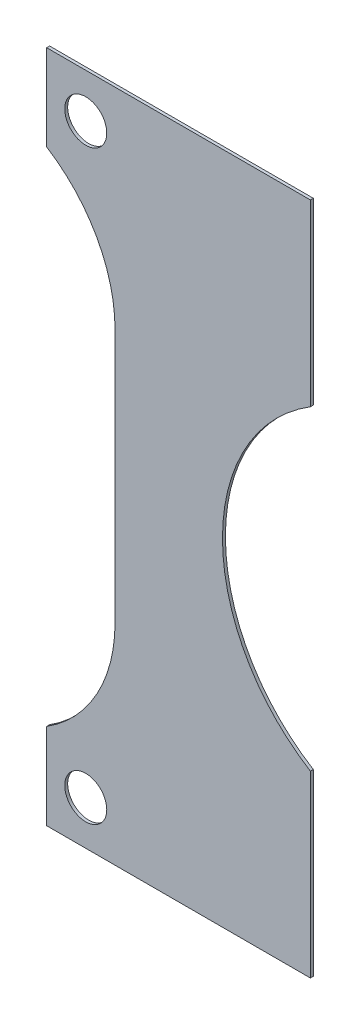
ISO-10303-21;
HEADER;
FILE_DESCRIPTION(('STEP AP214'),'2;1');
FILE_NAME('part.step','',(''),(''),'','','');
FILE_SCHEMA(('AUTOMOTIVE_DESIGN { 1 0 10303 214 1 1 1 1 }'));
ENDSEC;
DATA;
#1=APPLICATION_CONTEXT('core data for automotive mechanical design processes');
#2=APPLICATION_PROTOCOL_DEFINITION('international standard','automotive_design',2000,#1);
#3=PRODUCT_CONTEXT('',#1,'mechanical');
#4=PRODUCT('Part','Part','',(#3));
#5=PRODUCT_RELATED_PRODUCT_CATEGORY('part','',(#4));
#6=PRODUCT_DEFINITION_FORMATION('','',#4);
#7=PRODUCT_DEFINITION_CONTEXT('part definition',#1,'design');
#8=PRODUCT_DEFINITION('design','',#6,#7);
#9=PRODUCT_DEFINITION_SHAPE('','',#8);
#10=(LENGTH_UNIT() NAMED_UNIT(*) SI_UNIT(.MILLI.,.METRE.));
#11=(NAMED_UNIT(*) PLANE_ANGLE_UNIT() SI_UNIT($,.RADIAN.));
#12=(NAMED_UNIT(*) SI_UNIT($,.STERADIAN.) SOLID_ANGLE_UNIT());
#13=UNCERTAINTY_MEASURE_WITH_UNIT(LENGTH_MEASURE(1.E-05),#10,'distance_accuracy_value','');
#14=(GEOMETRIC_REPRESENTATION_CONTEXT(3) GLOBAL_UNCERTAINTY_ASSIGNED_CONTEXT((#13)) GLOBAL_UNIT_ASSIGNED_CONTEXT((#10,
#11,#12)) REPRESENTATION_CONTEXT('',''));
#15=CARTESIAN_POINT('',(0.,0.,0.));
#16=DIRECTION('',(0.,0.,1.));
#17=DIRECTION('',(1.,0.,0.));
#18=AXIS2_PLACEMENT_3D('',#15,#16,#17);
#19=CARTESIAN_POINT('',(0.,0.,0.3));
#20=DIRECTION('',(0.,0.,1.));
#21=DIRECTION('',(1.,0.,0.));
#22=AXIS2_PLACEMENT_3D('',#19,#20,#21);
#23=PLANE('',#22);
#24=CARTESIAN_POINT('',(0.,30.,0.3));
#25=DIRECTION('',(0.,0.,1.));
#26=DIRECTION('',(1.,0.,0.));
#27=AXIS2_PLACEMENT_3D('',#24,#25,#26);
#28=CIRCLE('',#27,2.15);
#29=CARTESIAN_POINT('',(2.15,30.,0.3));
#30=VERTEX_POINT('',#29);
#31=EDGE_CURVE('E168',#30,#30,#28,.F.);
#32=ORIENTED_EDGE('',*,*,#31,.T.);
#33=EDGE_LOOP('',(#32));
#34=FACE_BOUND('',#33,.T.);
#35=CARTESIAN_POINT('',(0.,-30.,0.3));
#36=DIRECTION('',(0.,0.,1.));
#37=DIRECTION('',(1.,0.,0.));
#38=AXIS2_PLACEMENT_3D('',#35,#36,#37);
#39=CIRCLE('',#38,2.15);
#40=CARTESIAN_POINT('',(2.15,-30.,0.3));
#41=VERTEX_POINT('',#40);
#42=EDGE_CURVE('E171',#41,#41,#39,.F.);
#43=ORIENTED_EDGE('',*,*,#42,.T.);
#44=EDGE_LOOP('',(#43));
#45=FACE_BOUND('',#44,.T.);
#46=DIRECTION('',(1.,0.,0.));
#47=VECTOR('',#46,1.);
#48=CARTESIAN_POINT('',(23.,34.5,0.3));
#49=LINE('',#48,#47);
#50=CARTESIAN_POINT('',(-4.,34.5,0.3));
#51=VERTEX_POINT('',#50);
#52=CARTESIAN_POINT('',(23.,34.5,0.3));
#53=VERTEX_POINT('',#52);
#54=EDGE_CURVE('E123',#51,#53,#49,.T.);
#55=ORIENTED_EDGE('',*,*,#54,.F.);
#56=DIRECTION('',(0.,1.,0.));
#57=VECTOR('',#56,1.);
#58=CARTESIAN_POINT('',(-4.,34.5,0.3));
#59=LINE('',#58,#57);
#60=CARTESIAN_POINT('',(-4.00000000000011,25.6885775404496,0.3));
#61=VERTEX_POINT('',#60);
#62=EDGE_CURVE('E92',#61,#51,#59,.T.);
#63=ORIENTED_EDGE('',*,*,#62,.F.);
#64=CARTESIAN_POINT('',(-12.,13.,0.3));
#65=DIRECTION('',(0.,0.,1.));
#66=DIRECTION('',(1.,0.,0.));
#67=AXIS2_PLACEMENT_3D('',#64,#65,#66);
#68=CIRCLE('',#67,15.);
#69=CARTESIAN_POINT('',(3.,13.,0.3));
#70=VERTEX_POINT('',#69);
#71=EDGE_CURVE('E21',#61,#70,#68,.F.);
#72=ORIENTED_EDGE('',*,*,#71,.T.);
#73=DIRECTION('',(0.,1.,0.));
#74=VECTOR('',#73,1.);
#75=CARTESIAN_POINT('',(3.,13.,0.3));
#76=LINE('',#75,#74);
#77=CARTESIAN_POINT('',(3.,-13.,0.3));
#78=VERTEX_POINT('',#77);
#79=EDGE_CURVE('E97',#78,#70,#76,.T.);
#80=ORIENTED_EDGE('',*,*,#79,.F.);
#81=CARTESIAN_POINT('',(-12.,-13.,0.3));
#82=DIRECTION('',(0.,0.,1.));
#83=DIRECTION('',(1.,0.,0.));
#84=AXIS2_PLACEMENT_3D('',#81,#82,#83);
#85=CIRCLE('',#84,15.);
#86=CARTESIAN_POINT('',(-4.,-25.6885775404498,0.3));
#87=VERTEX_POINT('',#86);
#88=EDGE_CURVE('E115',#78,#87,#85,.F.);
#89=ORIENTED_EDGE('',*,*,#88,.T.);
#90=DIRECTION('',(0.,1.,0.));
#91=VECTOR('',#90,1.);
#92=CARTESIAN_POINT('',(-4.,-25.68857754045,0.3));
#93=LINE('',#92,#91);
#94=CARTESIAN_POINT('',(-4.,-34.5,0.3));
#95=VERTEX_POINT('',#94);
#96=EDGE_CURVE('E149',#95,#87,#93,.T.);
#97=ORIENTED_EDGE('',*,*,#96,.F.);
#98=DIRECTION('',(1.,0.,0.));
#99=VECTOR('',#98,1.);
#100=CARTESIAN_POINT('',(-4.,-34.5,0.3));
#101=LINE('',#100,#99);
#102=CARTESIAN_POINT('',(23.,-34.5,0.3));
#103=VERTEX_POINT('',#102);
#104=EDGE_CURVE('E144',#103,#95,#101,.F.);
#105=ORIENTED_EDGE('',*,*,#104,.F.);
#106=DIRECTION('',(0.,1.,0.));
#107=VECTOR('',#106,1.);
#108=CARTESIAN_POINT('',(23.,-34.5,0.3));
#109=LINE('',#108,#107);
#110=CARTESIAN_POINT('',(22.9999999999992,-16.155494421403,0.3));
#111=VERTEX_POINT('',#110);
#112=EDGE_CURVE('E138',#111,#103,#109,.F.);
#113=ORIENTED_EDGE('',*,*,#112,.F.);
#114=CARTESIAN_POINT('',(33.,0.,0.3));
#115=DIRECTION('',(0.,0.,1.));
#116=DIRECTION('',(1.,0.,0.));
#117=AXIS2_PLACEMENT_3D('',#114,#115,#116);
#118=CIRCLE('',#117,19.);
#119=CARTESIAN_POINT('',(23.,16.1554944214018,0.3));
#120=VERTEX_POINT('',#119);
#121=EDGE_CURVE('E129',#111,#120,#118,.F.);
#122=ORIENTED_EDGE('',*,*,#121,.T.);
#123=DIRECTION('',(0.,1.,0.));
#124=VECTOR('',#123,1.);
#125=CARTESIAN_POINT('',(23.,16.1554944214,0.3));
#126=LINE('',#125,#124);
#127=EDGE_CURVE('E127',#53,#120,#126,.F.);
#128=ORIENTED_EDGE('',*,*,#127,.F.);
#129=EDGE_LOOP('',(#55,#63,#72,#80,#89,#97,#105,#113,#122,#128));
#130=FACE_BOUND('',#129,.T.);
#131=ADVANCED_FACE('F17',(#34,#45,#130),#23,.T.);
#132=CARTESIAN_POINT('',(-4.,34.5,0.));
#133=DIRECTION('',(-1.,0.,0.));
#134=DIRECTION('',(0.,0.,1.));
#135=AXIS2_PLACEMENT_3D('',#132,#133,#134);
#136=PLANE('',#135);
#137=DIRECTION('',(0.,0.,1.));
#138=VECTOR('',#137,1.);
#139=CARTESIAN_POINT('',(-4.,34.5,0.));
#140=LINE('',#139,#138);
#141=CARTESIAN_POINT('',(-4.,34.5,0.));
#142=VERTEX_POINT('',#141);
#143=EDGE_CURVE('E120',#142,#51,#140,.T.);
#144=ORIENTED_EDGE('',*,*,#143,.F.);
#145=DIRECTION('',(0.,1.,0.));
#146=VECTOR('',#145,1.);
#147=CARTESIAN_POINT('',(-4.,0.,0.));
#148=LINE('',#147,#146);
#149=CARTESIAN_POINT('',(-4.00000000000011,25.6885775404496,0.));
#150=VERTEX_POINT('',#149);
#151=EDGE_CURVE('E167',#142,#150,#148,.F.);
#152=ORIENTED_EDGE('',*,*,#151,.T.);
#153=DIRECTION('',(0.,0.,1.));
#154=VECTOR('',#153,1.);
#155=CARTESIAN_POINT('',(-4.00000000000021,25.6885775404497,0.));
#156=LINE('',#155,#154);
#157=EDGE_CURVE('E109',#150,#61,#156,.T.);
#158=ORIENTED_EDGE('',*,*,#157,.T.);
#159=ORIENTED_EDGE('',*,*,#62,.T.);
#160=EDGE_LOOP('',(#144,#152,#158,#159));
#161=FACE_BOUND('',#160,.T.);
#162=ADVANCED_FACE('F241',(#161),#136,.T.);
#163=CARTESIAN_POINT('',(-12.,13.,0.));
#164=DIRECTION('',(0.,0.,1.));
#165=DIRECTION('',(1.,0.,0.));
#166=AXIS2_PLACEMENT_3D('',#163,#164,#165);
#167=CYLINDRICAL_SURFACE('',#166,15.);
#168=ORIENTED_EDGE('',*,*,#71,.F.);
#169=ORIENTED_EDGE('',*,*,#157,.F.);
#170=CARTESIAN_POINT('',(-12.,13.,0.));
#171=DIRECTION('',(0.,0.,1.));
#172=DIRECTION('',(1.,0.,0.));
#173=AXIS2_PLACEMENT_3D('',#170,#171,#172);
#174=CIRCLE('',#173,15.);
#175=CARTESIAN_POINT('',(3.,13.,0.));
#176=VERTEX_POINT('',#175);
#177=EDGE_CURVE('E113',#150,#176,#174,.F.);
#178=ORIENTED_EDGE('',*,*,#177,.T.);
#179=DIRECTION('',(0.,0.,1.));
#180=VECTOR('',#179,1.);
#181=CARTESIAN_POINT('',(3.,13.,0.));
#182=LINE('',#181,#180);
#183=EDGE_CURVE('E101',#70,#176,#182,.F.);
#184=ORIENTED_EDGE('',*,*,#183,.F.);
#185=EDGE_LOOP('',(#168,#169,#178,#184));
#186=FACE_BOUND('',#185,.T.);
#187=ADVANCED_FACE('F111',(#186),#167,.F.);
#188=CARTESIAN_POINT('',(3.,13.,0.));
#189=DIRECTION('',(-1.,0.,0.));
#190=DIRECTION('',(0.,0.,1.));
#191=AXIS2_PLACEMENT_3D('',#188,#189,#190);
#192=PLANE('',#191);
#193=ORIENTED_EDGE('',*,*,#183,.T.);
#194=DIRECTION('',(0.,1.,0.));
#195=VECTOR('',#194,1.);
#196=CARTESIAN_POINT('',(3.,0.,0.));
#197=LINE('',#196,#195);
#198=CARTESIAN_POINT('',(3.,-13.,0.));
#199=VERTEX_POINT('',#198);
#200=EDGE_CURVE('E165',#176,#199,#197,.F.);
#201=ORIENTED_EDGE('',*,*,#200,.T.);
#202=DIRECTION('',(0.,0.,1.));
#203=VECTOR('',#202,1.);
#204=CARTESIAN_POINT('',(3.,-13.,0.));
#205=LINE('',#204,#203);
#206=EDGE_CURVE('E103',#199,#78,#205,.T.);
#207=ORIENTED_EDGE('',*,*,#206,.T.);
#208=ORIENTED_EDGE('',*,*,#79,.T.);
#209=EDGE_LOOP('',(#193,#201,#207,#208));
#210=FACE_BOUND('',#209,.T.);
#211=ADVANCED_FACE('F98',(#210),#192,.T.);
#212=CARTESIAN_POINT('',(-12.,-13.,0.));
#213=DIRECTION('',(0.,0.,1.));
#214=DIRECTION('',(1.,0.,0.));
#215=AXIS2_PLACEMENT_3D('',#212,#213,#214);
#216=CYLINDRICAL_SURFACE('',#215,15.);
#217=ORIENTED_EDGE('',*,*,#88,.F.);
#218=ORIENTED_EDGE('',*,*,#206,.F.);
#219=CARTESIAN_POINT('',(-12.,-13.,0.));
#220=DIRECTION('',(0.,0.,1.));
#221=DIRECTION('',(1.,0.,0.));
#222=AXIS2_PLACEMENT_3D('',#219,#220,#221);
#223=CIRCLE('',#222,15.);
#224=CARTESIAN_POINT('',(-4.,-25.6885775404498,0.));
#225=VERTEX_POINT('',#224);
#226=EDGE_CURVE('E161',#199,#225,#223,.F.);
#227=ORIENTED_EDGE('',*,*,#226,.T.);
#228=DIRECTION('',(0.,0.,1.));
#229=VECTOR('',#228,1.);
#230=CARTESIAN_POINT('',(-4.,-25.68857754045,0.));
#231=LINE('',#230,#229);
#232=EDGE_CURVE('E146',#87,#225,#231,.F.);
#233=ORIENTED_EDGE('',*,*,#232,.F.);
#234=EDGE_LOOP('',(#217,#218,#227,#233));
#235=FACE_BOUND('',#234,.T.);
#236=ADVANCED_FACE('F181',(#235),#216,.F.);
#237=CARTESIAN_POINT('',(-4.,-25.68857754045,0.));
#238=DIRECTION('',(-1.,0.,0.));
#239=DIRECTION('',(0.,0.,1.));
#240=AXIS2_PLACEMENT_3D('',#237,#238,#239);
#241=PLANE('',#240);
#242=ORIENTED_EDGE('',*,*,#232,.T.);
#243=DIRECTION('',(0.,1.,0.));
#244=VECTOR('',#243,1.);
#245=CARTESIAN_POINT('',(-4.,0.,0.));
#246=LINE('',#245,#244);
#247=CARTESIAN_POINT('',(-4.,-34.5,0.));
#248=VERTEX_POINT('',#247);
#249=EDGE_CURVE('E164',#225,#248,#246,.F.);
#250=ORIENTED_EDGE('',*,*,#249,.T.);
#251=DIRECTION('',(0.,0.,-1.));
#252=VECTOR('',#251,1.);
#253=CARTESIAN_POINT('',(-4.,-34.5,0.));
#254=LINE('',#253,#252);
#255=EDGE_CURVE('E141',#95,#248,#254,.T.);
#256=ORIENTED_EDGE('',*,*,#255,.F.);
#257=ORIENTED_EDGE('',*,*,#96,.T.);
#258=EDGE_LOOP('',(#242,#250,#256,#257));
#259=FACE_BOUND('',#258,.T.);
#260=ADVANCED_FACE('F238',(#259),#241,.T.);
#261=CARTESIAN_POINT('',(-4.,-34.5,0.));
#262=DIRECTION('',(0.,-1.,0.));
#263=DIRECTION('',(0.,0.,-1.));
#264=AXIS2_PLACEMENT_3D('',#261,#262,#263);
#265=PLANE('',#264);
#266=ORIENTED_EDGE('',*,*,#255,.T.);
#267=DIRECTION('',(1.,0.,0.));
#268=VECTOR('',#267,1.);
#269=CARTESIAN_POINT('',(0.,-34.5,0.));
#270=LINE('',#269,#268);
#271=CARTESIAN_POINT('',(23.,-34.5,0.));
#272=VERTEX_POINT('',#271);
#273=EDGE_CURVE('E192',#248,#272,#270,.T.);
#274=ORIENTED_EDGE('',*,*,#273,.T.);
#275=DIRECTION('',(0.,0.,-1.));
#276=VECTOR('',#275,1.);
#277=CARTESIAN_POINT('',(23.,-34.5,0.));
#278=LINE('',#277,#276);
#279=EDGE_CURVE('E140',#103,#272,#278,.T.);
#280=ORIENTED_EDGE('',*,*,#279,.F.);
#281=ORIENTED_EDGE('',*,*,#104,.T.);
#282=EDGE_LOOP('',(#266,#274,#280,#281));
#283=FACE_BOUND('',#282,.T.);
#284=ADVANCED_FACE('F237',(#283),#265,.T.);
#285=CARTESIAN_POINT('',(23.,-34.5,0.));
#286=DIRECTION('',(1.,0.,0.));
#287=DIRECTION('',(0.,0.,-1.));
#288=AXIS2_PLACEMENT_3D('',#285,#286,#287);
#289=PLANE('',#288);
#290=ORIENTED_EDGE('',*,*,#279,.T.);
#291=DIRECTION('',(0.,1.,0.));
#292=VECTOR('',#291,1.);
#293=CARTESIAN_POINT('',(23.,0.,0.));
#294=LINE('',#293,#292);
#295=CARTESIAN_POINT('',(22.9999999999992,-16.155494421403,0.));
#296=VERTEX_POINT('',#295);
#297=EDGE_CURVE('E160',#272,#296,#294,.T.);
#298=ORIENTED_EDGE('',*,*,#297,.T.);
#299=DIRECTION('',(0.,0.,1.));
#300=VECTOR('',#299,1.);
#301=CARTESIAN_POINT('',(22.9999999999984,-16.1554944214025,0.));
#302=LINE('',#301,#300);
#303=EDGE_CURVE('E175',#296,#111,#302,.T.);
#304=ORIENTED_EDGE('',*,*,#303,.T.);
#305=ORIENTED_EDGE('',*,*,#112,.T.);
#306=EDGE_LOOP('',(#290,#298,#304,#305));
#307=FACE_BOUND('',#306,.T.);
#308=ADVANCED_FACE('F233',(#307),#289,.T.);
#309=CARTESIAN_POINT('',(33.,0.,0.));
#310=DIRECTION('',(0.,0.,1.));
#311=DIRECTION('',(1.,0.,0.));
#312=AXIS2_PLACEMENT_3D('',#309,#310,#311);
#313=CYLINDRICAL_SURFACE('',#312,19.);
#314=ORIENTED_EDGE('',*,*,#121,.F.);
#315=ORIENTED_EDGE('',*,*,#303,.F.);
#316=CARTESIAN_POINT('',(33.,0.,0.));
#317=DIRECTION('',(0.,0.,1.));
#318=DIRECTION('',(1.,0.,0.));
#319=AXIS2_PLACEMENT_3D('',#316,#317,#318);
#320=CIRCLE('',#319,19.);
#321=CARTESIAN_POINT('',(23.,16.1554944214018,0.));
#322=VERTEX_POINT('',#321);
#323=EDGE_CURVE('E156',#296,#322,#320,.F.);
#324=ORIENTED_EDGE('',*,*,#323,.T.);
#325=DIRECTION('',(0.,0.,-1.));
#326=VECTOR('',#325,1.);
#327=CARTESIAN_POINT('',(23.,16.1554944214,0.));
#328=LINE('',#327,#326);
#329=EDGE_CURVE('E124',#120,#322,#328,.T.);
#330=ORIENTED_EDGE('',*,*,#329,.F.);
#331=EDGE_LOOP('',(#314,#315,#324,#330));
#332=FACE_BOUND('',#331,.T.);
#333=ADVANCED_FACE('F231',(#332),#313,.F.);
#334=CARTESIAN_POINT('',(23.,16.1554944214,0.));
#335=DIRECTION('',(1.,0.,0.));
#336=DIRECTION('',(0.,0.,-1.));
#337=AXIS2_PLACEMENT_3D('',#334,#335,#336);
#338=PLANE('',#337);
#339=ORIENTED_EDGE('',*,*,#329,.T.);
#340=DIRECTION('',(0.,1.,0.));
#341=VECTOR('',#340,1.);
#342=CARTESIAN_POINT('',(23.,0.,0.));
#343=LINE('',#342,#341);
#344=CARTESIAN_POINT('',(23.,34.5,0.));
#345=VERTEX_POINT('',#344);
#346=EDGE_CURVE('E159',#322,#345,#343,.T.);
#347=ORIENTED_EDGE('',*,*,#346,.T.);
#348=DIRECTION('',(0.,0.,1.));
#349=VECTOR('',#348,1.);
#350=CARTESIAN_POINT('',(23.,34.5,0.));
#351=LINE('',#350,#349);
#352=EDGE_CURVE('E36',#53,#345,#351,.F.);
#353=ORIENTED_EDGE('',*,*,#352,.F.);
#354=ORIENTED_EDGE('',*,*,#127,.T.);
#355=EDGE_LOOP('',(#339,#347,#353,#354));
#356=FACE_BOUND('',#355,.T.);
#357=ADVANCED_FACE('F224',(#356),#338,.T.);
#358=CARTESIAN_POINT('',(23.,34.5,0.));
#359=DIRECTION('',(0.,1.,0.));
#360=DIRECTION('',(0.,0.,1.));
#361=AXIS2_PLACEMENT_3D('',#358,#359,#360);
#362=PLANE('',#361);
#363=ORIENTED_EDGE('',*,*,#352,.T.);
#364=DIRECTION('',(1.,0.,0.));
#365=VECTOR('',#364,1.);
#366=CARTESIAN_POINT('',(0.,34.5,0.));
#367=LINE('',#366,#365);
#368=EDGE_CURVE('E155',#345,#142,#367,.F.);
#369=ORIENTED_EDGE('',*,*,#368,.T.);
#370=ORIENTED_EDGE('',*,*,#143,.T.);
#371=ORIENTED_EDGE('',*,*,#54,.T.);
#372=EDGE_LOOP('',(#363,#369,#370,#371));
#373=FACE_BOUND('',#372,.T.);
#374=ADVANCED_FACE('F242',(#373),#362,.T.);
#375=CARTESIAN_POINT('',(0.,-30.,0.));
#376=DIRECTION('',(0.,0.,1.));
#377=DIRECTION('',(1.,0.,0.));
#378=AXIS2_PLACEMENT_3D('',#375,#376,#377);
#379=CYLINDRICAL_SURFACE('',#378,2.15);
#380=ORIENTED_EDGE('',*,*,#42,.F.);
#381=EDGE_LOOP('',(#380));
#382=FACE_BOUND('',#381,.T.);
#383=CARTESIAN_POINT('',(0.,-30.,0.));
#384=DIRECTION('',(0.,0.,1.));
#385=DIRECTION('',(1.,0.,0.));
#386=AXIS2_PLACEMENT_3D('',#383,#384,#385);
#387=CIRCLE('',#386,2.15);
#388=CARTESIAN_POINT('',(2.15,-30.,0.));
#389=VERTEX_POINT('',#388);
#390=EDGE_CURVE('E27',#389,#389,#387,.F.);
#391=ORIENTED_EDGE('',*,*,#390,.T.);
#392=EDGE_LOOP('',(#391));
#393=FACE_BOUND('',#392,.T.);
#394=ADVANCED_FACE('F244',(#382,#393),#379,.F.);
#395=CARTESIAN_POINT('',(0.,30.,0.));
#396=DIRECTION('',(0.,0.,1.));
#397=DIRECTION('',(1.,0.,0.));
#398=AXIS2_PLACEMENT_3D('',#395,#396,#397);
#399=CYLINDRICAL_SURFACE('',#398,2.15);
#400=ORIENTED_EDGE('',*,*,#31,.F.);
#401=EDGE_LOOP('',(#400));
#402=FACE_BOUND('',#401,.T.);
#403=CARTESIAN_POINT('',(0.,30.,0.));
#404=DIRECTION('',(0.,0.,1.));
#405=DIRECTION('',(1.,0.,0.));
#406=AXIS2_PLACEMENT_3D('',#403,#404,#405);
#407=CIRCLE('',#406,2.15);
#408=CARTESIAN_POINT('',(2.15,30.,0.));
#409=VERTEX_POINT('',#408);
#410=EDGE_CURVE('E11',#409,#409,#407,.F.);
#411=ORIENTED_EDGE('',*,*,#410,.T.);
#412=EDGE_LOOP('',(#411));
#413=FACE_BOUND('',#412,.T.);
#414=ADVANCED_FACE('F251',(#402,#413),#399,.F.);
#415=CARTESIAN_POINT('',(0.,0.,0.));
#416=DIRECTION('',(0.,0.,1.));
#417=DIRECTION('',(1.,0.,0.));
#418=AXIS2_PLACEMENT_3D('',#415,#416,#417);
#419=PLANE('',#418);
#420=ORIENTED_EDGE('',*,*,#410,.F.);
#421=EDGE_LOOP('',(#420));
#422=FACE_BOUND('',#421,.T.);
#423=ORIENTED_EDGE('',*,*,#390,.F.);
#424=EDGE_LOOP('',(#423));
#425=FACE_BOUND('',#424,.T.);
#426=ORIENTED_EDGE('',*,*,#346,.F.);
#427=ORIENTED_EDGE('',*,*,#323,.F.);
#428=ORIENTED_EDGE('',*,*,#297,.F.);
#429=ORIENTED_EDGE('',*,*,#273,.F.);
#430=ORIENTED_EDGE('',*,*,#249,.F.);
#431=ORIENTED_EDGE('',*,*,#226,.F.);
#432=ORIENTED_EDGE('',*,*,#200,.F.);
#433=ORIENTED_EDGE('',*,*,#177,.F.);
#434=ORIENTED_EDGE('',*,*,#151,.F.);
#435=ORIENTED_EDGE('',*,*,#368,.F.);
#436=EDGE_LOOP('',(#426,#427,#428,#429,#430,#431,#432,#433,#434,#435));
#437=FACE_BOUND('',#436,.T.);
#438=ADVANCED_FACE('F19',(#422,#425,#437),#419,.F.);
#439=CLOSED_SHELL('',(#131,#162,#187,#211,#236,#260,#284,#308,#333,#357,#374,#394,#414,#438));
#440=MANIFOLD_SOLID_BREP('B1',#439);
#441=ADVANCED_BREP_SHAPE_REPRESENTATION('',(#18,#440),#14);
#442=SHAPE_DEFINITION_REPRESENTATION(#9,#441);
ENDSEC;
END-ISO-10303-21;
